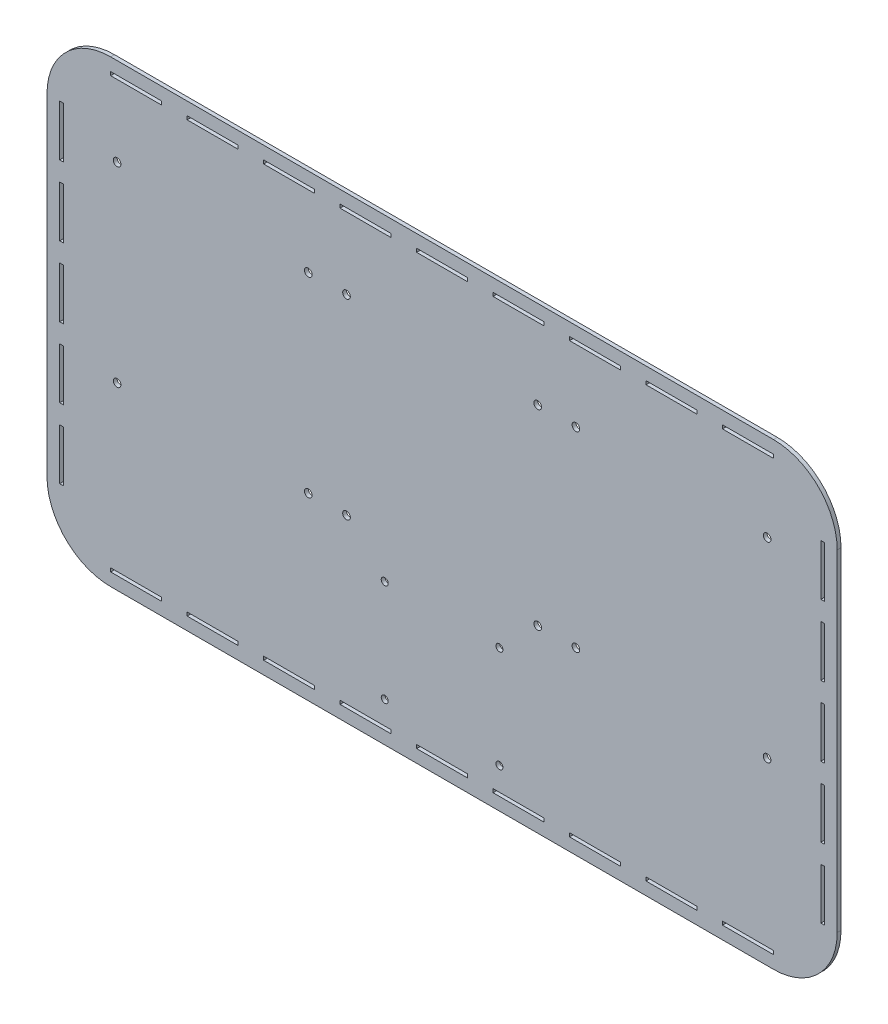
from build123d import *

# Parameters (mm, degrees)
BOSS_EXTRUDE1_DEPTH = 3
SKETCH5_W           = 2.8
SKETCH5_H           = 40
SKETCH5_W_2         = 40
SKETCH5_H_2         = 2.8
CUT_EXTRUDE4_DEPTH  = 3
SKETCH6_R           = 2.75
SKETCH6_R_2         = 3
CUT_EXTRUDE5_DEPTH  = 10


with BuildPart() as part:
    # Sketch1 → Boss-Extrude1 (new body)
    with BuildSketch(Plane.XY):
        with BuildLine():
            Line((260, -180), (-260, -180))
            ThreePointArc((-260, -180), (-295.355339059, -165.355339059), (-310, -130))
            Line((-310, -130), (-310, 130))
            ThreePointArc((-310, 130), (-295.355339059, 165.355339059), (-260, 180))
            Line((-260, 180), (260, 180))
            ThreePointArc((260, 180), (295.355339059, 165.355339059), (310, 130))
            Line((310, 130), (310, -130))
            ThreePointArc((310, -130), (295.355339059, -165.355339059), (260, -180))
        make_face()
    extrude(amount=BOSS_EXTRUDE1_DEPTH)

    # Sketch5 → Cut-Extrude4 (cut)
    with BuildSketch(Plane.XY.offset(3)):
        with Locations((-298.6, 110)):
            Rectangle(SKETCH5_W, SKETCH5_H)
        with Locations((-298.6, 55)):
            Rectangle(SKETCH5_W, SKETCH5_H)
        with Locations((-298.6, 0)):
            Rectangle(SKETCH5_W, SKETCH5_H)
        with Locations((-298.6, -55)):
            Rectangle(SKETCH5_W, SKETCH5_H)
        with Locations((-298.6, -110)):
            Rectangle(SKETCH5_W, SKETCH5_H)
        with Locations((298.6, -110)):
            Rectangle(SKETCH5_W, SKETCH5_H)
        with Locations((298.6, -55)):
            Rectangle(SKETCH5_W, SKETCH5_H)
        with Locations((298.6, 0)):
            Rectangle(SKETCH5_W, SKETCH5_H)
        with Locations((298.6, 55)):
            Rectangle(SKETCH5_W, SKETCH5_H)
        with Locations((298.6, 110)):
            Rectangle(SKETCH5_W, SKETCH5_H)
        with Locations((-240, 168.6)):
            Rectangle(SKETCH5_W_2, SKETCH5_H_2)
        with Locations((-180, 168.6)):
            Rectangle(SKETCH5_W_2, SKETCH5_H_2)
        with Locations((-120, 168.6)):
            Rectangle(SKETCH5_W_2, SKETCH5_H_2)
        with Locations((-60, 168.6)):
            Rectangle(SKETCH5_W_2, SKETCH5_H_2)
        with Locations((0, 168.6)):
            Rectangle(SKETCH5_W_2, SKETCH5_H_2)
        with Locations((60, 168.6)):
            Rectangle(SKETCH5_W_2, SKETCH5_H_2)
        with Locations((120, 168.6)):
            Rectangle(SKETCH5_W_2, SKETCH5_H_2)
        with Locations((180, 168.6)):
            Rectangle(SKETCH5_W_2, SKETCH5_H_2)
        with Locations((240, 168.6)):
            Rectangle(SKETCH5_W_2, SKETCH5_H_2)
        with Locations((240, -168.6)):
            Rectangle(SKETCH5_W_2, SKETCH5_H_2)
        with Locations((180, -168.6)):
            Rectangle(SKETCH5_W_2, SKETCH5_H_2)
        with Locations((120, -168.6)):
            Rectangle(SKETCH5_W_2, SKETCH5_H_2)
        with Locations((60, -168.6)):
            Rectangle(SKETCH5_W_2, SKETCH5_H_2)
        with Locations((0, -168.6)):
            Rectangle(SKETCH5_W_2, SKETCH5_H_2)
        with Locations((-60, -168.6)):
            Rectangle(SKETCH5_W_2, SKETCH5_H_2)
        with Locations((-120, -168.6)):
            Rectangle(SKETCH5_W_2, SKETCH5_H_2)
        with Locations((-180, -168.6)):
            Rectangle(SKETCH5_W_2, SKETCH5_H_2)
        with Locations((-240, -168.6)):
            Rectangle(SKETCH5_W_2, SKETCH5_H_2)
    extrude(amount=-CUT_EXTRUDE4_DEPTH, mode=Mode.SUBTRACT)

    # Sketch6 → Cut-Extrude5 (cut)
    with BuildSketch(Plane.XY.offset(3)):
        with Locations((-45, -69)):
            Circle(SKETCH6_R)
        with Locations((-45, -149)):
            Circle(SKETCH6_R)
        with Locations((45, -149)):
            Circle(SKETCH6_R)
        with Locations((45, -69)):
            Circle(SKETCH6_R)
        with Locations((-255, 111)):
            Circle(SKETCH6_R_2)
        with Locations((-255, -39)):
            Circle(SKETCH6_R_2)
        with Locations((-105, 111)):
            Circle(SKETCH6_R_2)
        with Locations((-105, -39)):
            Circle(SKETCH6_R_2)
        with Locations((-75, -39)):
            Circle(SKETCH6_R_2)
        with Locations((-75, 111)):
            Circle(SKETCH6_R_2)
        with Locations((75, 111)):
            Circle(SKETCH6_R_2)
        with Locations((75, -39)):
            Circle(SKETCH6_R_2)
        with Locations((105, 111)):
            Circle(SKETCH6_R_2)
        with Locations((105, -39)):
            Circle(SKETCH6_R_2)
        with Locations((255, -39)):
            Circle(SKETCH6_R_2)
        with Locations((255, 111)):
            Circle(SKETCH6_R_2)
    extrude(amount=-CUT_EXTRUDE5_DEPTH, mode=Mode.SUBTRACT)


solid = part.part
